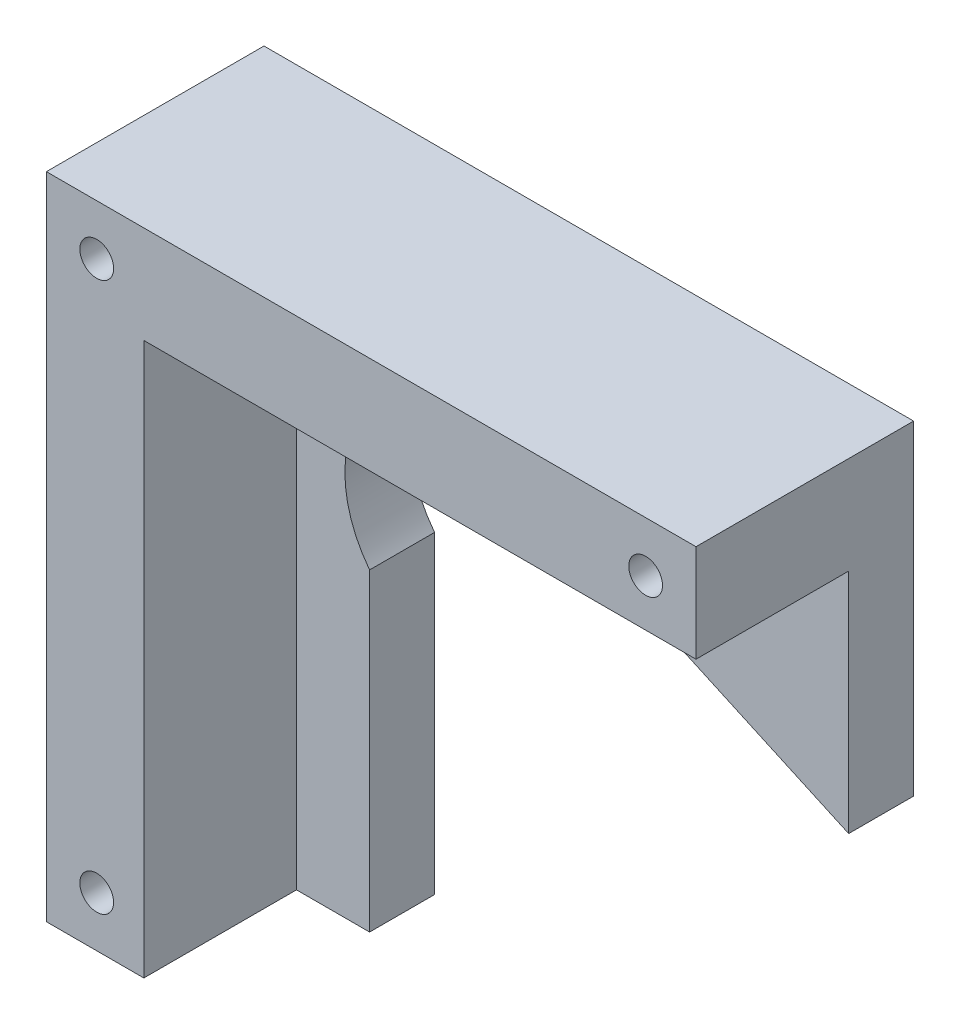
from build123d import *

# Parameters (mm, degrees)
ESQUISSE1_W             = 100
ESQUISSE1_H             = 100
BOSS_EXTRU_1_DEPTH      = 33.5
ESQUISSE2_W             = 85
ESQUISSE2_H             = 85
ENL_V_MAT_EXTRU_1_DEPTH = 23.5
ESQUISSE3_R             = 2.6
ENL_V_MAT_EXTRU_4_DEPTH = 40


with BuildPart() as part:
    # Esquisse1 → Boss.-Extru.1 (new body)
    with BuildSketch(Plane.XY):
        with Locations((-9.989339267, -20.147485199)):
            Rectangle(ESQUISSE1_W, ESQUISSE1_H)
    extrude(amount=BOSS_EXTRU_1_DEPTH)

    # Esquisse2 → Enl_v. mat.-Extru.1 (cut)
    with BuildSketch(Plane.XY.offset(33.5)):
        with Locations((-2.489339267, -27.647485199)):
            Rectangle(ESQUISSE2_W, ESQUISSE2_H)
    extrude(amount=-ENL_V_MAT_EXTRU_1_DEPTH, mode=Mode.SUBTRACT)

    # Esquisse3 → Enl_v. mat.-Extru.4 (cut)
    with BuildSketch(Plane.XY):
        with Locations((32.260660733, 22.102514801)):
            Circle(ESQUISSE3_R)
        with Locations((-52.239339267, -62.397485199)):
            Circle(ESQUISSE3_R)
        with Locations((-52.239339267, 22.102514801)):
            Circle(ESQUISSE3_R)
        with BuildLine():
            Line((-9.989339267, -70.147485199), (40.010660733, -70.147485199))
            Line((40.010660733, -70.147485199), (40.010660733, -20.147485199))
            Line((40.010660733, -20.147485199), (-5.043568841, 0.37102958))
            ThreePointArc((-5.043568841, 0.37102958), (-30.507854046, 3.598285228), (-33.735109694, -21.865999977))
            Line((-33.735109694, -21.865999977), (-33.735109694, -70.147485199))
            Line((-33.735109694, -70.147485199), (-9.989339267, -70.147485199))
        make_face()
    extrude(amount=ENL_V_MAT_EXTRU_4_DEPTH, mode=Mode.SUBTRACT)


solid = part.part
